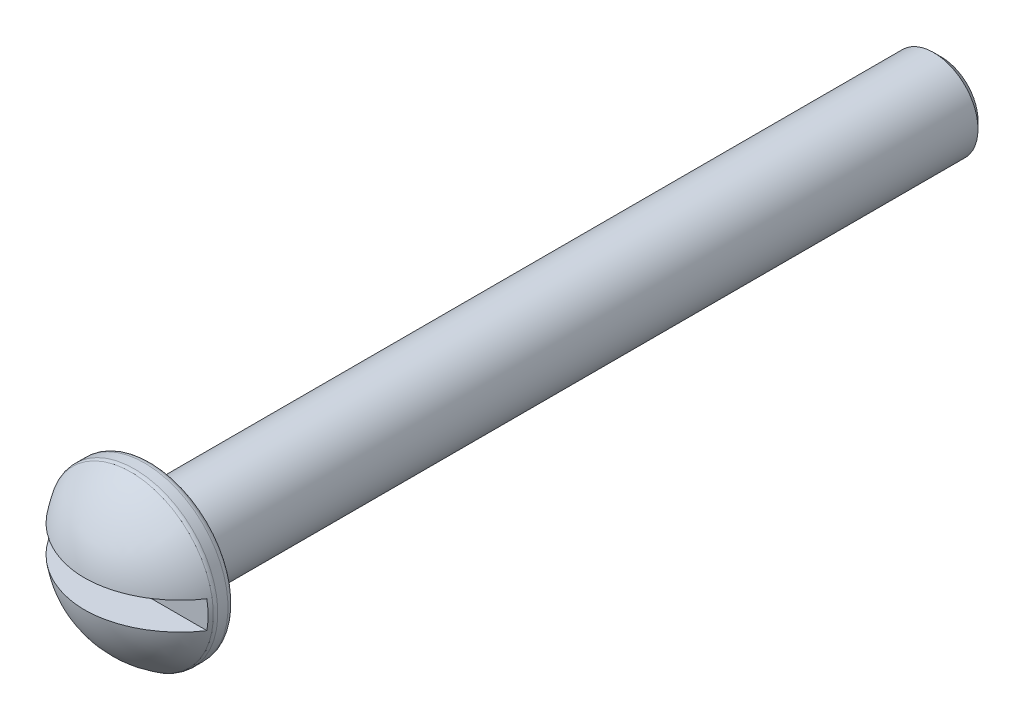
from build123d import *

# Parameters (mm, degrees)
SKETCH2_W      = 6.335928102
SKETCH2_H      = 0.889
EXTRUDE1_DEPTH = 1.778


with BuildPart() as part:
    # Sketch1 → Revolve1 (revolve)
    with BuildSketch(Plane(origin=(0, 0, 0), x_dir=(0, 0, -1), z_dir=(1, 0, 0)), mode=Mode.PRIVATE) as revolve1_sk:
        Polygon((0, 0), (0, 1.4224), (-25.4, 1.4224), (-25.4, 2.6797), (-29.484096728, 2.6797), (-29.484096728, 0), align=None)
    revolve(revolve1_sk.sketch.rotate(Axis((0, 0, 29.484096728), (0, 0, -1)), 90), axis=Axis((0, 0, 29.484096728), (0, 0, -1)))

    # Sketch3 → Cut-Revolve1 (revolve, cut)
    with BuildSketch(Plane(origin=(0, 0, 0), x_dir=(0, 0, -1), z_dir=(1, 0, 0)), mode=Mode.PRIVATE) as cut_revolve1_sk:
        with BuildLine():
            Line((-25.9461, 2.6797), (-25.61844, 2.6797))
            ThreePointArc((-25.61844, 2.6797), (-25.463979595, 2.615720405), (-25.4, 2.46126))
            Line((-25.4, 2.46126), (-24.910585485, 2.46126))
            Line((-24.910585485, 2.46126), (-24.910585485, 3.3147))
            Line((-24.910585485, 3.3147), (-29.885515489, 3.3147))
            Line((-29.885515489, 3.3147), (-29.885515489, 0))
            Line((-29.885515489, 0), (-27.590676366, 0))
            ThreePointArc((-27.590676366, 0), (-27.165133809, 1.520923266), (-26.059036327, 2.64823973))
            ThreePointArc((-26.059036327, 2.64823973), (-26.004718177, 2.671687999), (-25.9461, 2.6797))
        make_face()
        Polygon((-0.433685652, 1.612997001), (0, 1.179311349), (0, 1.612997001), align=None)
    revolve(cut_revolve1_sk.sketch.rotate(Axis((0, 0, 0), (0, 0, 1)), 90), axis=Axis((0, 0, 0), (0, 0, 1)), mode=Mode.SUBTRACT)

    # Sketch2 → Extrude1 (cut)
    with BuildSketch(Plane.XY.offset(27.94)):
        Rectangle(SKETCH2_W, SKETCH2_H)
    extrude(amount=-EXTRUDE1_DEPTH, mode=Mode.SUBTRACT)


solid = part.part
